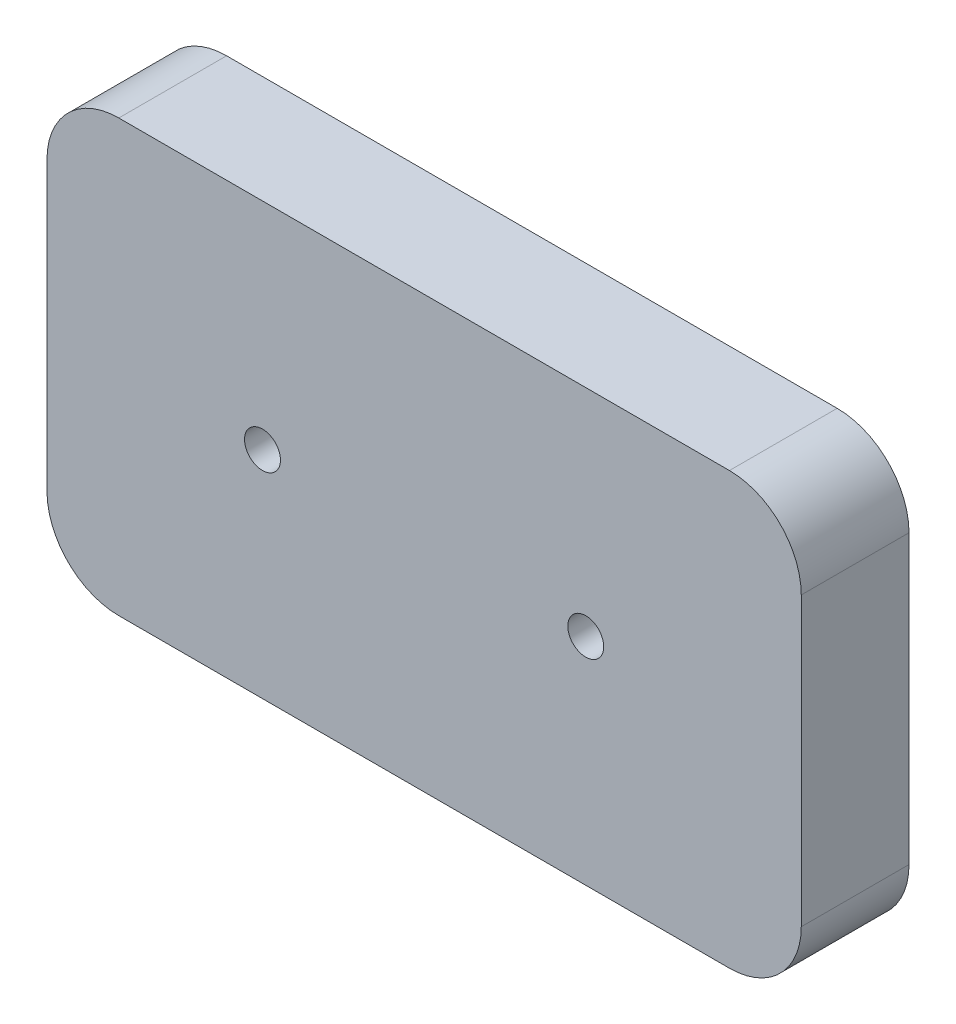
from build123d import *

# Parameters (mm, degrees)
BOSS_EXTRU_3_DEPTH      = 3
ENL_V_MAT_EXTRU_4_DEPTH = 1.7
ESQUISSE9_R             = 0.5
ENL_V_MAT_EXTRU_5_DEPTH = 13.212288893


with BuildPart() as part:
    # Esquisse4 → Boss.-Extru.3 (new body)
    with BuildSketch(Plane.XY):
        with BuildLine():
            Line((-8.5, -6), (8.5, -6))
            ThreePointArc((8.5, -6), (9.914213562, -5.414213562), (10.5, -4))
            Line((10.5, -4), (10.5, 4))
            ThreePointArc((10.5, 4), (9.914213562, 5.414213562), (8.5, 6))
            Line((8.5, 6), (-8.5, 6))
            ThreePointArc((-8.5, 6), (-9.914213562, 5.414213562), (-10.5, 4))
            Line((-10.5, 4), (-10.5, -4))
            ThreePointArc((-10.5, -4), (-9.914213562, -5.414213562), (-8.5, -6))
        make_face()
    extrude(amount=-BOSS_EXTRU_3_DEPTH)

    # Esquisse8 → Enl_v. mat.-Extru.4 (cut)
    with BuildSketch(Plane(origin=(0, 0, -3), x_dir=(-1, 0, 0), z_dir=(0, 0, -1))):
        with BuildLine():
            Line((-8.5, -5), (8.5, -5))
            ThreePointArc((8.5, -5), (9.207106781, -4.707106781), (9.5, -4))
            Line((9.5, -4), (9.5, 4))
            ThreePointArc((9.5, 4), (9.207106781, 4.707106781), (8.5, 5))
            Line((8.5, 5), (-8.5, 5))
            ThreePointArc((-8.5, 5), (-9.207106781, 4.707106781), (-9.5, 4))
            Line((-9.5, 4), (-9.5, -4))
            ThreePointArc((-9.5, -4), (-9.207106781, -4.707106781), (-8.5, -5))
        make_face()
    extrude(amount=-ENL_V_MAT_EXTRU_4_DEPTH, mode=Mode.SUBTRACT)

    # Esquisse9 → Enl_v. mat.-Extru.5 (cut, through all)
    with BuildSketch(Plane(origin=(0, 0, -1.3), x_dir=(-1, 0, 0), z_dir=(0, 0, -1))):
        with Locations((4.5, 0)):
            Circle(ESQUISSE9_R)
        with Locations((-4.5, 0)):
            Circle(ESQUISSE9_R)
    extrude(amount=-ENL_V_MAT_EXTRU_5_DEPTH, mode=Mode.SUBTRACT)


solid = part.part
